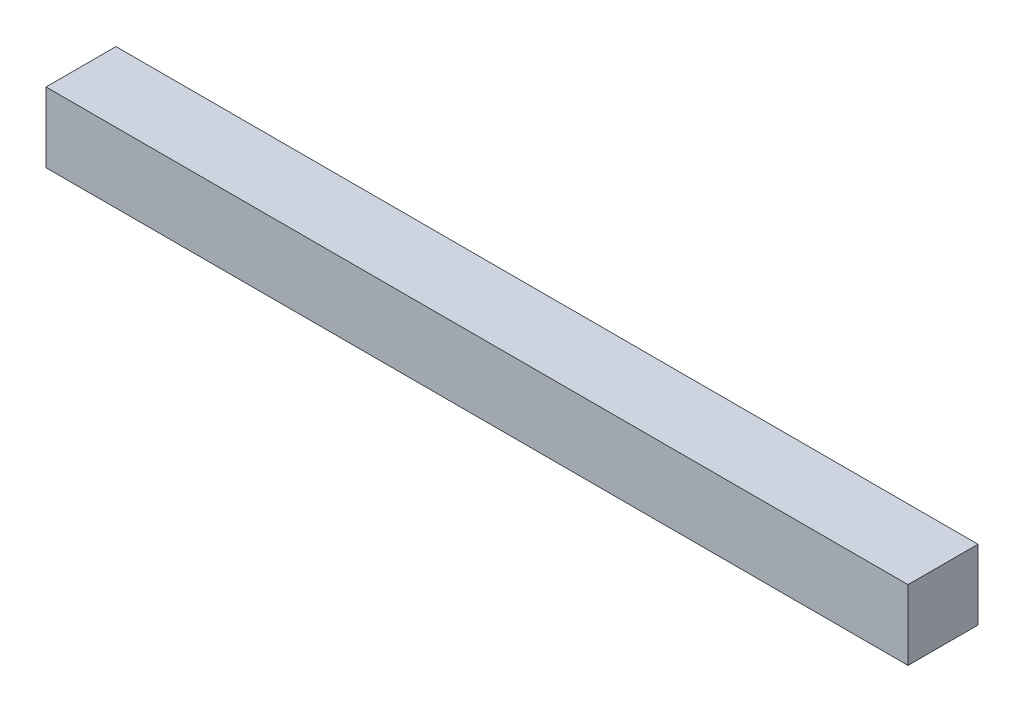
ISO-10303-21;
HEADER;
FILE_DESCRIPTION(('STEP AP214'),'2;1');
FILE_NAME('part.step','',(''),(''),'','','');
FILE_SCHEMA(('AUTOMOTIVE_DESIGN { 1 0 10303 214 1 1 1 1 }'));
ENDSEC;
DATA;
#1=APPLICATION_CONTEXT('core data for automotive mechanical design processes');
#2=APPLICATION_PROTOCOL_DEFINITION('international standard','automotive_design',2000,#1);
#3=PRODUCT_CONTEXT('',#1,'mechanical');
#4=PRODUCT('Part','Part','',(#3));
#5=PRODUCT_RELATED_PRODUCT_CATEGORY('part','',(#4));
#6=PRODUCT_DEFINITION_FORMATION('','',#4);
#7=PRODUCT_DEFINITION_CONTEXT('part definition',#1,'design');
#8=PRODUCT_DEFINITION('design','',#6,#7);
#9=PRODUCT_DEFINITION_SHAPE('','',#8);
#10=(LENGTH_UNIT() NAMED_UNIT(*) SI_UNIT(.MILLI.,.METRE.));
#11=(NAMED_UNIT(*) PLANE_ANGLE_UNIT() SI_UNIT($,.RADIAN.));
#12=(NAMED_UNIT(*) SI_UNIT($,.STERADIAN.) SOLID_ANGLE_UNIT());
#13=UNCERTAINTY_MEASURE_WITH_UNIT(LENGTH_MEASURE(1.E-05),#10,'distance_accuracy_value','');
#14=(GEOMETRIC_REPRESENTATION_CONTEXT(3) GLOBAL_UNCERTAINTY_ASSIGNED_CONTEXT((#13)) GLOBAL_UNIT_ASSIGNED_CONTEXT((#10,
#11,#12)) REPRESENTATION_CONTEXT('',''));
#15=CARTESIAN_POINT('',(0.,0.,0.));
#16=DIRECTION('',(0.,0.,1.));
#17=DIRECTION('',(1.,0.,0.));
#18=AXIS2_PLACEMENT_3D('',#15,#16,#17);
#19=CARTESIAN_POINT('',(-13.1248792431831,-3.66862222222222,2.));
#20=DIRECTION('',(1.,0.,0.));
#21=DIRECTION('',(0.,0.,-1.));
#22=AXIS2_PLACEMENT_3D('',#19,#20,#21);
#23=PLANE('',#22);
#24=DIRECTION('',(0.,-1.,0.));
#25=VECTOR('',#24,1.);
#26=CARTESIAN_POINT('',(-13.1248792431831,-3.66862222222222,0.));
#27=LINE('',#26,#25);
#28=CARTESIAN_POINT('',(-13.1248792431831,-1.66862222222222,0.));
#29=VERTEX_POINT('',#28);
#30=CARTESIAN_POINT('',(-13.1248792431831,-3.66862222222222,0.));
#31=VERTEX_POINT('',#30);
#32=EDGE_CURVE('E96',#29,#31,#27,.T.);
#33=ORIENTED_EDGE('',*,*,#32,.T.);
#34=DIRECTION('',(0.,0.,-1.));
#35=VECTOR('',#34,1.);
#36=CARTESIAN_POINT('',(-13.1248792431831,-3.66862222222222,2.));
#37=LINE('',#36,#35);
#38=CARTESIAN_POINT('',(-13.1248792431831,-3.66862222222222,2.));
#39=VERTEX_POINT('',#38);
#40=EDGE_CURVE('E11',#39,#31,#37,.T.);
#41=ORIENTED_EDGE('',*,*,#40,.F.);
#42=DIRECTION('',(0.,-1.,0.));
#43=VECTOR('',#42,1.);
#44=CARTESIAN_POINT('',(-13.1248792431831,-3.66862222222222,2.));
#45=LINE('',#44,#43);
#46=CARTESIAN_POINT('',(-13.1248792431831,-1.66862222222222,2.));
#47=VERTEX_POINT('',#46);
#48=EDGE_CURVE('E84',#47,#39,#45,.T.);
#49=ORIENTED_EDGE('',*,*,#48,.F.);
#50=DIRECTION('',(0.,0.,-1.));
#51=VECTOR('',#50,1.);
#52=CARTESIAN_POINT('',(-13.1248792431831,-1.66862222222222,2.));
#53=LINE('',#52,#51);
#54=EDGE_CURVE('E92',#47,#29,#53,.T.);
#55=ORIENTED_EDGE('',*,*,#54,.T.);
#56=EDGE_LOOP('',(#33,#41,#49,#55));
#57=FACE_BOUND('',#56,.T.);
#58=ADVANCED_FACE('F33',(#57),#23,.F.);
#59=CARTESIAN_POINT('',(-13.1248792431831,-3.66862222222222,2.));
#60=DIRECTION('',(0.,1.,0.));
#61=DIRECTION('',(0.,0.,1.));
#62=AXIS2_PLACEMENT_3D('',#59,#60,#61);
#63=PLANE('',#62);
#64=DIRECTION('',(1.,0.,0.));
#65=VECTOR('',#64,1.);
#66=CARTESIAN_POINT('',(-13.1248792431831,-3.66862222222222,0.));
#67=LINE('',#66,#65);
#68=CARTESIAN_POINT('',(11.5151207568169,-3.66862222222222,0.));
#69=VERTEX_POINT('',#68);
#70=EDGE_CURVE('E88',#31,#69,#67,.T.);
#71=ORIENTED_EDGE('',*,*,#70,.T.);
#72=DIRECTION('',(0.,0.,-1.));
#73=VECTOR('',#72,1.);
#74=CARTESIAN_POINT('',(11.5151207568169,-3.66862222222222,2.));
#75=LINE('',#74,#73);
#76=CARTESIAN_POINT('',(11.5151207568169,-3.66862222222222,2.));
#77=VERTEX_POINT('',#76);
#78=EDGE_CURVE('E41',#77,#69,#75,.T.);
#79=ORIENTED_EDGE('',*,*,#78,.F.);
#80=DIRECTION('',(1.,0.,0.));
#81=VECTOR('',#80,1.);
#82=CARTESIAN_POINT('',(-13.1248792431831,-3.66862222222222,2.));
#83=LINE('',#82,#81);
#84=EDGE_CURVE('E79',#39,#77,#83,.T.);
#85=ORIENTED_EDGE('',*,*,#84,.F.);
#86=ORIENTED_EDGE('',*,*,#40,.T.);
#87=EDGE_LOOP('',(#71,#79,#85,#86));
#88=FACE_BOUND('',#87,.T.);
#89=ADVANCED_FACE('F87',(#88),#63,.F.);
#90=CARTESIAN_POINT('',(11.5151207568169,-3.66862222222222,2.));
#91=DIRECTION('',(-1.,0.,0.));
#92=DIRECTION('',(0.,0.,1.));
#93=AXIS2_PLACEMENT_3D('',#90,#91,#92);
#94=PLANE('',#93);
#95=DIRECTION('',(0.,1.,0.));
#96=VECTOR('',#95,1.);
#97=CARTESIAN_POINT('',(11.5151207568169,-3.66862222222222,0.));
#98=LINE('',#97,#96);
#99=CARTESIAN_POINT('',(11.5151207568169,-1.66862222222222,0.));
#100=VERTEX_POINT('',#99);
#101=EDGE_CURVE('E66',#69,#100,#98,.T.);
#102=ORIENTED_EDGE('',*,*,#101,.T.);
#103=DIRECTION('',(0.,0.,-1.));
#104=VECTOR('',#103,1.);
#105=CARTESIAN_POINT('',(11.5151207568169,-1.66862222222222,2.));
#106=LINE('',#105,#104);
#107=CARTESIAN_POINT('',(11.5151207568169,-1.66862222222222,2.));
#108=VERTEX_POINT('',#107);
#109=EDGE_CURVE('E89',#108,#100,#106,.T.);
#110=ORIENTED_EDGE('',*,*,#109,.F.);
#111=DIRECTION('',(0.,1.,0.));
#112=VECTOR('',#111,1.);
#113=CARTESIAN_POINT('',(11.5151207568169,-3.66862222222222,2.));
#114=LINE('',#113,#112);
#115=EDGE_CURVE('E82',#77,#108,#114,.T.);
#116=ORIENTED_EDGE('',*,*,#115,.F.);
#117=ORIENTED_EDGE('',*,*,#78,.T.);
#118=EDGE_LOOP('',(#102,#110,#116,#117));
#119=FACE_BOUND('',#118,.T.);
#120=ADVANCED_FACE('F90',(#119),#94,.F.);
#121=CARTESIAN_POINT('',(-13.1248792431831,-1.66862222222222,2.));
#122=DIRECTION('',(0.,-1.,0.));
#123=DIRECTION('',(0.,0.,-1.));
#124=AXIS2_PLACEMENT_3D('',#121,#122,#123);
#125=PLANE('',#124);
#126=DIRECTION('',(-1.,0.,0.));
#127=VECTOR('',#126,1.);
#128=CARTESIAN_POINT('',(-13.1248792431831,-1.66862222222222,0.));
#129=LINE('',#128,#127);
#130=EDGE_CURVE('E72',#100,#29,#129,.T.);
#131=ORIENTED_EDGE('',*,*,#130,.T.);
#132=ORIENTED_EDGE('',*,*,#54,.F.);
#133=DIRECTION('',(-1.,0.,0.));
#134=VECTOR('',#133,1.);
#135=CARTESIAN_POINT('',(-13.1248792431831,-1.66862222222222,2.));
#136=LINE('',#135,#134);
#137=EDGE_CURVE('E49',#108,#47,#136,.T.);
#138=ORIENTED_EDGE('',*,*,#137,.F.);
#139=ORIENTED_EDGE('',*,*,#109,.T.);
#140=EDGE_LOOP('',(#131,#132,#138,#139));
#141=FACE_BOUND('',#140,.T.);
#142=ADVANCED_FACE('F103',(#141),#125,.F.);
#143=CARTESIAN_POINT('',(0.,0.,2.));
#144=DIRECTION('',(0.,0.,-1.));
#145=DIRECTION('',(-1.,0.,0.));
#146=AXIS2_PLACEMENT_3D('',#143,#144,#145);
#147=PLANE('',#146);
#148=ORIENTED_EDGE('',*,*,#48,.T.);
#149=ORIENTED_EDGE('',*,*,#84,.T.);
#150=ORIENTED_EDGE('',*,*,#115,.T.);
#151=ORIENTED_EDGE('',*,*,#137,.T.);
#152=EDGE_LOOP('',(#148,#149,#150,#151));
#153=FACE_BOUND('',#152,.T.);
#154=ADVANCED_FACE('F80',(#153),#147,.F.);
#155=CARTESIAN_POINT('',(0.,0.,0.));
#156=DIRECTION('',(0.,0.,-1.));
#157=DIRECTION('',(-1.,0.,0.));
#158=AXIS2_PLACEMENT_3D('',#155,#156,#157);
#159=PLANE('',#158);
#160=ORIENTED_EDGE('',*,*,#32,.F.);
#161=ORIENTED_EDGE('',*,*,#130,.F.);
#162=ORIENTED_EDGE('',*,*,#101,.F.);
#163=ORIENTED_EDGE('',*,*,#70,.F.);
#164=EDGE_LOOP('',(#160,#161,#162,#163));
#165=FACE_BOUND('',#164,.T.);
#166=ADVANCED_FACE('F106',(#165),#159,.T.);
#167=CLOSED_SHELL('',(#58,#89,#120,#142,#154,#166));
#168=MANIFOLD_SOLID_BREP('B2',#167);
#169=ADVANCED_BREP_SHAPE_REPRESENTATION('',(#18,#168),#14);
#170=SHAPE_DEFINITION_REPRESENTATION(#9,#169);
ENDSEC;
END-ISO-10303-21;
